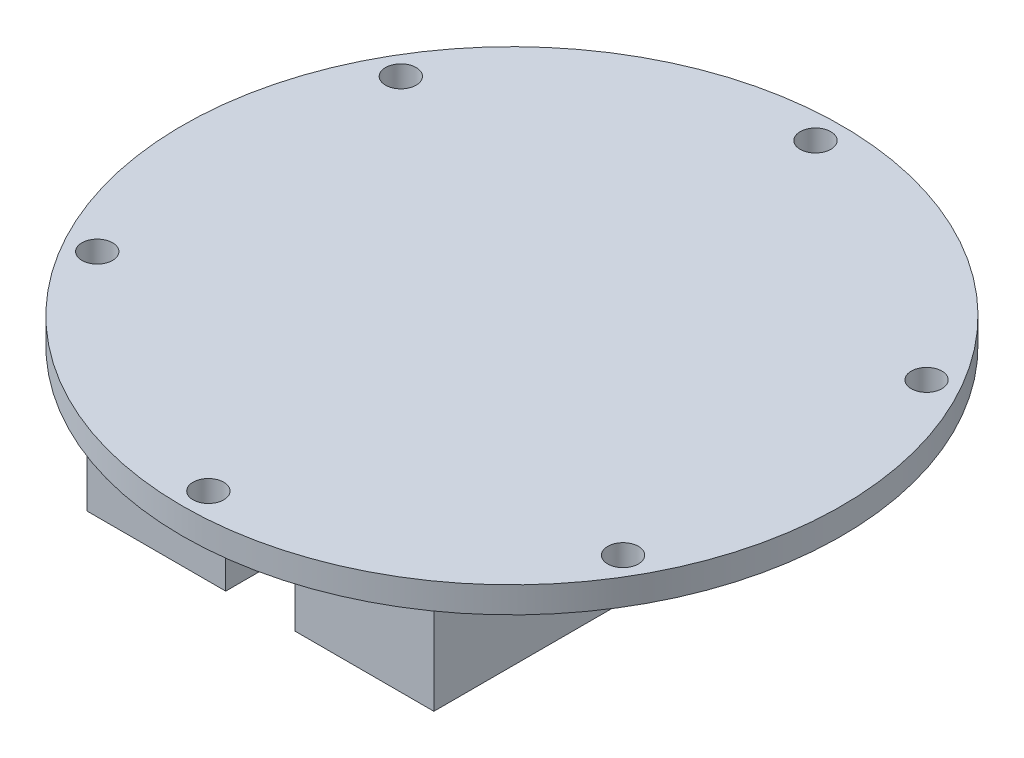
ISO-10303-21;
HEADER;
FILE_DESCRIPTION(('STEP AP214'),'2;1');
FILE_NAME('part.step','',(''),(''),'','','');
FILE_SCHEMA(('AUTOMOTIVE_DESIGN { 1 0 10303 214 1 1 1 1 }'));
ENDSEC;
DATA;
#1=APPLICATION_CONTEXT('core data for automotive mechanical design processes');
#2=APPLICATION_PROTOCOL_DEFINITION('international standard','automotive_design',2000,#1);
#3=PRODUCT_CONTEXT('',#1,'mechanical');
#4=PRODUCT('Part','Part','',(#3));
#5=PRODUCT_RELATED_PRODUCT_CATEGORY('part','',(#4));
#6=PRODUCT_DEFINITION_FORMATION('','',#4);
#7=PRODUCT_DEFINITION_CONTEXT('part definition',#1,'design');
#8=PRODUCT_DEFINITION('design','',#6,#7);
#9=PRODUCT_DEFINITION_SHAPE('','',#8);
#10=(LENGTH_UNIT() NAMED_UNIT(*) SI_UNIT(.MILLI.,.METRE.));
#11=(NAMED_UNIT(*) PLANE_ANGLE_UNIT() SI_UNIT($,.RADIAN.));
#12=(NAMED_UNIT(*) SI_UNIT($,.STERADIAN.) SOLID_ANGLE_UNIT());
#13=UNCERTAINTY_MEASURE_WITH_UNIT(LENGTH_MEASURE(1.E-05),#10,'distance_accuracy_value','');
#14=(GEOMETRIC_REPRESENTATION_CONTEXT(3) GLOBAL_UNCERTAINTY_ASSIGNED_CONTEXT((#13)) GLOBAL_UNIT_ASSIGNED_CONTEXT((#10,
#11,#12)) REPRESENTATION_CONTEXT('',''));
#15=CARTESIAN_POINT('',(0.,0.,0.));
#16=DIRECTION('',(0.,0.,1.));
#17=DIRECTION('',(1.,0.,0.));
#18=AXIS2_PLACEMENT_3D('',#15,#16,#17);
#19=CARTESIAN_POINT('',(-60.325,-157.1625,0.));
#20=DIRECTION('',(0.,-1.,0.));
#21=DIRECTION('',(0.,0.,-1.));
#22=AXIS2_PLACEMENT_3D('',#19,#20,#21);
#23=PLANE('',#22);
#24=DIRECTION('',(1.,0.,0.));
#25=VECTOR('',#24,1.);
#26=CARTESIAN_POINT('',(-31.75,-157.1625,-46.0375));
#27=LINE('',#26,#25);
#28=CARTESIAN_POINT('',(-31.75,-157.1625,-46.0375));
#29=VERTEX_POINT('',#28);
#30=CARTESIAN_POINT('',(-6.34999999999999,-157.1625,-46.0375));
#31=VERTEX_POINT('',#30);
#32=EDGE_CURVE('E141',#29,#31,#27,.T.);
#33=ORIENTED_EDGE('',*,*,#32,.F.);
#34=DIRECTION('',(0.,0.,-1.));
#35=VECTOR('',#34,1.);
#36=CARTESIAN_POINT('',(-31.75,-157.1625,46.0375));
#37=LINE('',#36,#35);
#38=CARTESIAN_POINT('',(-31.75,-157.1625,46.0375));
#39=VERTEX_POINT('',#38);
#40=EDGE_CURVE('E110',#39,#29,#37,.T.);
#41=ORIENTED_EDGE('',*,*,#40,.F.);
#42=DIRECTION('',(-1.,0.,0.));
#43=VECTOR('',#42,1.);
#44=CARTESIAN_POINT('',(-31.75,-157.1625,46.0375));
#45=LINE('',#44,#43);
#46=CARTESIAN_POINT('',(-6.35,-157.1625,46.0375));
#47=VERTEX_POINT('',#46);
#48=EDGE_CURVE('E145',#47,#39,#45,.T.);
#49=ORIENTED_EDGE('',*,*,#48,.F.);
#50=DIRECTION('',(0.,0.,1.));
#51=VECTOR('',#50,1.);
#52=CARTESIAN_POINT('',(-6.35000000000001,-157.1625,46.0375));
#53=LINE('',#52,#51);
#54=EDGE_CURVE('E143',#31,#47,#53,.T.);
#55=ORIENTED_EDGE('',*,*,#54,.F.);
#56=EDGE_LOOP('',(#33,#41,#49,#55));
#57=FACE_BOUND('',#56,.T.);
#58=CARTESIAN_POINT('',(0.,-157.1625,55.5625));
#59=DIRECTION('',(0.,-1.,0.));
#60=DIRECTION('',(0.,0.,-1.));
#61=AXIS2_PLACEMENT_3D('',#58,#59,#60);
#62=CIRCLE('',#61,2.8067);
#63=CARTESIAN_POINT('',(0.,-157.1625,52.7558));
#64=VERTEX_POINT('',#63);
#65=EDGE_CURVE('E168',#64,#64,#62,.T.);
#66=ORIENTED_EDGE('',*,*,#65,.F.);
#67=EDGE_LOOP('',(#66));
#68=FACE_BOUND('',#67,.T.);
#69=CARTESIAN_POINT('',(48.1185364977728,-157.1625,27.7812500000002));
#70=DIRECTION('',(0.,-1.,0.));
#71=DIRECTION('',(0.,0.,-1.));
#72=AXIS2_PLACEMENT_3D('',#69,#70,#71);
#73=CIRCLE('',#72,2.8067);
#74=CARTESIAN_POINT('',(48.1185364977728,-157.1625,24.9745500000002));
#75=VERTEX_POINT('',#74);
#76=EDGE_CURVE('E174',#75,#75,#73,.T.);
#77=ORIENTED_EDGE('',*,*,#76,.F.);
#78=EDGE_LOOP('',(#77));
#79=FACE_BOUND('',#78,.T.);
#80=CARTESIAN_POINT('',(48.1185364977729,-157.1625,-27.7812499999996));
#81=DIRECTION('',(0.,-1.,0.));
#82=DIRECTION('',(0.,0.,-1.));
#83=AXIS2_PLACEMENT_3D('',#80,#81,#82);
#84=CIRCLE('',#83,2.8067);
#85=CARTESIAN_POINT('',(48.1185364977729,-157.1625,-30.5879499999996));
#86=VERTEX_POINT('',#85);
#87=EDGE_CURVE('E180',#86,#86,#84,.T.);
#88=ORIENTED_EDGE('',*,*,#87,.F.);
#89=EDGE_LOOP('',(#88));
#90=FACE_BOUND('',#89,.T.);
#91=CARTESIAN_POINT('',(2.91433543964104E-13,-157.1625,-55.5624999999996));
#92=DIRECTION('',(0.,-1.,0.));
#93=DIRECTION('',(0.,0.,-1.));
#94=AXIS2_PLACEMENT_3D('',#91,#92,#93);
#95=CIRCLE('',#94,2.8067);
#96=CARTESIAN_POINT('',(2.91433543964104E-13,-157.1625,-58.3691999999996));
#97=VERTEX_POINT('',#96);
#98=EDGE_CURVE('E186',#97,#97,#95,.T.);
#99=ORIENTED_EDGE('',*,*,#98,.F.);
#100=EDGE_LOOP('',(#99));
#101=FACE_BOUND('',#100,.T.);
#102=CARTESIAN_POINT('',(-48.1185364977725,-157.1625,-27.7812499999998));
#103=DIRECTION('',(0.,-1.,0.));
#104=DIRECTION('',(0.,0.,-1.));
#105=AXIS2_PLACEMENT_3D('',#102,#103,#104);
#106=CIRCLE('',#105,2.8067);
#107=CARTESIAN_POINT('',(-48.1185364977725,-157.1625,-30.5879499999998));
#108=VERTEX_POINT('',#107);
#109=EDGE_CURVE('E192',#108,#108,#106,.T.);
#110=ORIENTED_EDGE('',*,*,#109,.F.);
#111=EDGE_LOOP('',(#110));
#112=FACE_BOUND('',#111,.T.);
#113=CARTESIAN_POINT('',(-48.1185364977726,-157.1625,27.78125));
#114=DIRECTION('',(0.,-1.,0.));
#115=DIRECTION('',(0.,0.,-1.));
#116=AXIS2_PLACEMENT_3D('',#113,#114,#115);
#117=CIRCLE('',#116,2.8067);
#118=CARTESIAN_POINT('',(-48.1185364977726,-157.1625,24.97455));
#119=VERTEX_POINT('',#118);
#120=EDGE_CURVE('E198',#119,#119,#117,.T.);
#121=ORIENTED_EDGE('',*,*,#120,.F.);
#122=EDGE_LOOP('',(#121));
#123=FACE_BOUND('',#122,.T.);
#124=CARTESIAN_POINT('',(0.,-157.1625,0.));
#125=DIRECTION('',(0.,1.,0.));
#126=DIRECTION('',(0.,0.,1.));
#127=AXIS2_PLACEMENT_3D('',#124,#125,#126);
#128=CIRCLE('',#127,60.325);
#129=CARTESIAN_POINT('',(0.,-157.1625,60.325));
#130=VERTEX_POINT('',#129);
#131=EDGE_CURVE('E11',#130,#130,#128,.T.);
#132=ORIENTED_EDGE('',*,*,#131,.F.);
#133=EDGE_LOOP('',(#132));
#134=FACE_BOUND('',#133,.T.);
#135=DIRECTION('',(0.,0.,-1.));
#136=VECTOR('',#135,1.);
#137=CARTESIAN_POINT('',(6.35000000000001,-157.1625,46.0375));
#138=LINE('',#137,#136);
#139=CARTESIAN_POINT('',(6.35000000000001,-157.1625,46.0375));
#140=VERTEX_POINT('',#139);
#141=CARTESIAN_POINT('',(6.34999999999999,-157.1625,-46.0375));
#142=VERTEX_POINT('',#141);
#143=EDGE_CURVE('E104',#140,#142,#138,.T.);
#144=ORIENTED_EDGE('',*,*,#143,.F.);
#145=DIRECTION('',(-1.,0.,0.));
#146=VECTOR('',#145,1.);
#147=CARTESIAN_POINT('',(31.75,-157.1625,46.0375));
#148=LINE('',#147,#146);
#149=CARTESIAN_POINT('',(31.75,-157.1625,46.0375));
#150=VERTEX_POINT('',#149);
#151=EDGE_CURVE('E115',#150,#140,#148,.T.);
#152=ORIENTED_EDGE('',*,*,#151,.F.);
#153=DIRECTION('',(0.,0.,1.));
#154=VECTOR('',#153,1.);
#155=CARTESIAN_POINT('',(31.75,-157.1625,46.0375));
#156=LINE('',#155,#154);
#157=CARTESIAN_POINT('',(31.75,-157.1625,-46.0375));
#158=VERTEX_POINT('',#157);
#159=EDGE_CURVE('E125',#158,#150,#156,.T.);
#160=ORIENTED_EDGE('',*,*,#159,.F.);
#161=DIRECTION('',(1.,0.,0.));
#162=VECTOR('',#161,1.);
#163=CARTESIAN_POINT('',(31.75,-157.1625,-46.0375));
#164=LINE('',#163,#162);
#165=EDGE_CURVE('E123',#142,#158,#164,.T.);
#166=ORIENTED_EDGE('',*,*,#165,.F.);
#167=EDGE_LOOP('',(#144,#152,#160,#166));
#168=FACE_BOUND('',#167,.T.);
#169=ADVANCED_FACE('F33',(#57,#68,#79,#90,#101,#112,#123,#134,#168),#23,.T.);
#170=CARTESIAN_POINT('',(-60.325,-152.4,0.));
#171=DIRECTION('',(0.,1.,0.));
#172=DIRECTION('',(0.,0.,1.));
#173=AXIS2_PLACEMENT_3D('',#170,#171,#172);
#174=PLANE('',#173);
#175=CARTESIAN_POINT('',(0.,-152.4,55.5625));
#176=DIRECTION('',(0.,-1.,0.));
#177=DIRECTION('',(0.,0.,-1.));
#178=AXIS2_PLACEMENT_3D('',#175,#176,#177);
#179=CIRCLE('',#178,2.8067);
#180=CARTESIAN_POINT('',(0.,-152.4,52.7558));
#181=VERTEX_POINT('',#180);
#182=EDGE_CURVE('E165',#181,#181,#179,.T.);
#183=ORIENTED_EDGE('',*,*,#182,.T.);
#184=EDGE_LOOP('',(#183));
#185=FACE_BOUND('',#184,.T.);
#186=CARTESIAN_POINT('',(48.1185364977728,-152.4,27.7812500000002));
#187=DIRECTION('',(0.,-1.,0.));
#188=DIRECTION('',(0.,0.,-1.));
#189=AXIS2_PLACEMENT_3D('',#186,#187,#188);
#190=CIRCLE('',#189,2.8067);
#191=CARTESIAN_POINT('',(48.1185364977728,-152.4,24.9745500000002));
#192=VERTEX_POINT('',#191);
#193=EDGE_CURVE('E171',#192,#192,#190,.T.);
#194=ORIENTED_EDGE('',*,*,#193,.T.);
#195=EDGE_LOOP('',(#194));
#196=FACE_BOUND('',#195,.T.);
#197=CARTESIAN_POINT('',(48.1185364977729,-152.4,-27.7812499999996));
#198=DIRECTION('',(0.,-1.,0.));
#199=DIRECTION('',(0.,0.,-1.));
#200=AXIS2_PLACEMENT_3D('',#197,#198,#199);
#201=CIRCLE('',#200,2.8067);
#202=CARTESIAN_POINT('',(48.1185364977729,-152.4,-30.5879499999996));
#203=VERTEX_POINT('',#202);
#204=EDGE_CURVE('E177',#203,#203,#201,.T.);
#205=ORIENTED_EDGE('',*,*,#204,.T.);
#206=EDGE_LOOP('',(#205));
#207=FACE_BOUND('',#206,.T.);
#208=CARTESIAN_POINT('',(2.91433543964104E-13,-152.4,-55.5624999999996));
#209=DIRECTION('',(0.,-1.,0.));
#210=DIRECTION('',(0.,0.,-1.));
#211=AXIS2_PLACEMENT_3D('',#208,#209,#210);
#212=CIRCLE('',#211,2.8067);
#213=CARTESIAN_POINT('',(2.91433543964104E-13,-152.4,-58.3691999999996));
#214=VERTEX_POINT('',#213);
#215=EDGE_CURVE('E183',#214,#214,#212,.T.);
#216=ORIENTED_EDGE('',*,*,#215,.T.);
#217=EDGE_LOOP('',(#216));
#218=FACE_BOUND('',#217,.T.);
#219=CARTESIAN_POINT('',(-48.1185364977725,-152.4,-27.7812499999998));
#220=DIRECTION('',(0.,-1.,0.));
#221=DIRECTION('',(0.,0.,-1.));
#222=AXIS2_PLACEMENT_3D('',#219,#220,#221);
#223=CIRCLE('',#222,2.8067);
#224=CARTESIAN_POINT('',(-48.1185364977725,-152.4,-30.5879499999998));
#225=VERTEX_POINT('',#224);
#226=EDGE_CURVE('E189',#225,#225,#223,.T.);
#227=ORIENTED_EDGE('',*,*,#226,.T.);
#228=EDGE_LOOP('',(#227));
#229=FACE_BOUND('',#228,.T.);
#230=CARTESIAN_POINT('',(0.,-152.4,0.));
#231=DIRECTION('',(0.,1.,0.));
#232=DIRECTION('',(0.,0.,1.));
#233=AXIS2_PLACEMENT_3D('',#230,#231,#232);
#234=CIRCLE('',#233,60.325);
#235=CARTESIAN_POINT('',(0.,-152.4,60.325));
#236=VERTEX_POINT('',#235);
#237=EDGE_CURVE('E41',#236,#236,#234,.T.);
#238=ORIENTED_EDGE('',*,*,#237,.T.);
#239=EDGE_LOOP('',(#238));
#240=FACE_BOUND('',#239,.T.);
#241=CARTESIAN_POINT('',(-48.1185364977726,-152.4,27.78125));
#242=DIRECTION('',(0.,-1.,0.));
#243=DIRECTION('',(0.,0.,-1.));
#244=AXIS2_PLACEMENT_3D('',#241,#242,#243);
#245=CIRCLE('',#244,2.8067);
#246=CARTESIAN_POINT('',(-48.1185364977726,-152.4,24.97455));
#247=VERTEX_POINT('',#246);
#248=EDGE_CURVE('E195',#247,#247,#245,.T.);
#249=ORIENTED_EDGE('',*,*,#248,.T.);
#250=EDGE_LOOP('',(#249));
#251=FACE_BOUND('',#250,.T.);
#252=ADVANCED_FACE('F203',(#185,#196,#207,#218,#229,#240,#251),#174,.T.);
#253=CARTESIAN_POINT('',(0.,0.,0.));
#254=DIRECTION('',(0.,1.,0.));
#255=DIRECTION('',(0.,0.,1.));
#256=AXIS2_PLACEMENT_3D('',#253,#254,#255);
#257=CYLINDRICAL_SURFACE('',#256,60.325);
#258=ORIENTED_EDGE('',*,*,#131,.T.);
#259=EDGE_LOOP('',(#258));
#260=FACE_BOUND('',#259,.T.);
#261=ORIENTED_EDGE('',*,*,#237,.F.);
#262=EDGE_LOOP('',(#261));
#263=FACE_BOUND('',#262,.T.);
#264=ADVANCED_FACE('F35',(#260,#263),#257,.T.);
#265=CARTESIAN_POINT('',(-48.1185364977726,-157.1625,27.78125));
#266=DIRECTION('',(0.,-1.,0.));
#267=DIRECTION('',(0.,0.,-1.));
#268=AXIS2_PLACEMENT_3D('',#265,#266,#267);
#269=CYLINDRICAL_SURFACE('',#268,2.8067);
#270=ORIENTED_EDGE('',*,*,#248,.F.);
#271=EDGE_LOOP('',(#270));
#272=FACE_BOUND('',#271,.T.);
#273=ORIENTED_EDGE('',*,*,#120,.T.);
#274=EDGE_LOOP('',(#273));
#275=FACE_BOUND('',#274,.T.);
#276=ADVANCED_FACE('F207',(#272,#275),#269,.F.);
#277=CARTESIAN_POINT('',(-48.1185364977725,-157.1625,-27.7812499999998));
#278=DIRECTION('',(0.,-1.,0.));
#279=DIRECTION('',(0.,0.,-1.));
#280=AXIS2_PLACEMENT_3D('',#277,#278,#279);
#281=CYLINDRICAL_SURFACE('',#280,2.8067);
#282=ORIENTED_EDGE('',*,*,#226,.F.);
#283=EDGE_LOOP('',(#282));
#284=FACE_BOUND('',#283,.T.);
#285=ORIENTED_EDGE('',*,*,#109,.T.);
#286=EDGE_LOOP('',(#285));
#287=FACE_BOUND('',#286,.T.);
#288=ADVANCED_FACE('F213',(#284,#287),#281,.F.);
#289=CARTESIAN_POINT('',(2.91433543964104E-13,-157.1625,-55.5624999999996));
#290=DIRECTION('',(0.,-1.,0.));
#291=DIRECTION('',(0.,0.,-1.));
#292=AXIS2_PLACEMENT_3D('',#289,#290,#291);
#293=CYLINDRICAL_SURFACE('',#292,2.8067);
#294=ORIENTED_EDGE('',*,*,#215,.F.);
#295=EDGE_LOOP('',(#294));
#296=FACE_BOUND('',#295,.T.);
#297=ORIENTED_EDGE('',*,*,#98,.T.);
#298=EDGE_LOOP('',(#297));
#299=FACE_BOUND('',#298,.T.);
#300=ADVANCED_FACE('F227',(#296,#299),#293,.F.);
#301=CARTESIAN_POINT('',(48.1185364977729,-157.1625,-27.7812499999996));
#302=DIRECTION('',(0.,-1.,0.));
#303=DIRECTION('',(0.,0.,-1.));
#304=AXIS2_PLACEMENT_3D('',#301,#302,#303);
#305=CYLINDRICAL_SURFACE('',#304,2.8067);
#306=ORIENTED_EDGE('',*,*,#204,.F.);
#307=EDGE_LOOP('',(#306));
#308=FACE_BOUND('',#307,.T.);
#309=ORIENTED_EDGE('',*,*,#87,.T.);
#310=EDGE_LOOP('',(#309));
#311=FACE_BOUND('',#310,.T.);
#312=ADVANCED_FACE('F231',(#308,#311),#305,.F.);
#313=CARTESIAN_POINT('',(48.1185364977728,-157.1625,27.7812500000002));
#314=DIRECTION('',(0.,-1.,0.));
#315=DIRECTION('',(0.,0.,-1.));
#316=AXIS2_PLACEMENT_3D('',#313,#314,#315);
#317=CYLINDRICAL_SURFACE('',#316,2.8067);
#318=ORIENTED_EDGE('',*,*,#193,.F.);
#319=EDGE_LOOP('',(#318));
#320=FACE_BOUND('',#319,.T.);
#321=ORIENTED_EDGE('',*,*,#76,.T.);
#322=EDGE_LOOP('',(#321));
#323=FACE_BOUND('',#322,.T.);
#324=ADVANCED_FACE('F235',(#320,#323),#317,.F.);
#325=CARTESIAN_POINT('',(0.,-157.1625,55.5625));
#326=DIRECTION('',(0.,-1.,0.));
#327=DIRECTION('',(0.,0.,-1.));
#328=AXIS2_PLACEMENT_3D('',#325,#326,#327);
#329=CYLINDRICAL_SURFACE('',#328,2.8067);
#330=ORIENTED_EDGE('',*,*,#182,.F.);
#331=EDGE_LOOP('',(#330));
#332=FACE_BOUND('',#331,.T.);
#333=ORIENTED_EDGE('',*,*,#65,.T.);
#334=EDGE_LOOP('',(#333));
#335=FACE_BOUND('',#334,.T.);
#336=ADVANCED_FACE('F239',(#332,#335),#329,.F.);
#337=CARTESIAN_POINT('',(-31.75,-176.2125,46.0375));
#338=DIRECTION('',(1.,0.,0.));
#339=DIRECTION('',(0.,0.,-1.));
#340=AXIS2_PLACEMENT_3D('',#337,#338,#339);
#341=PLANE('',#340);
#342=ORIENTED_EDGE('',*,*,#40,.T.);
#343=DIRECTION('',(0.,1.,0.));
#344=VECTOR('',#343,1.);
#345=CARTESIAN_POINT('',(-31.75,-176.2125,-46.0375));
#346=LINE('',#345,#344);
#347=CARTESIAN_POINT('',(-31.75,-176.2125,-46.0375));
#348=VERTEX_POINT('',#347);
#349=EDGE_CURVE('E163',#348,#29,#346,.T.);
#350=ORIENTED_EDGE('',*,*,#349,.F.);
#351=DIRECTION('',(0.,0.,-1.));
#352=VECTOR('',#351,1.);
#353=CARTESIAN_POINT('',(-31.75,-176.2125,46.0375));
#354=LINE('',#353,#352);
#355=CARTESIAN_POINT('',(-31.75,-176.2125,46.0375));
#356=VERTEX_POINT('',#355);
#357=EDGE_CURVE('E147',#356,#348,#354,.T.);
#358=ORIENTED_EDGE('',*,*,#357,.F.);
#359=DIRECTION('',(0.,1.,0.));
#360=VECTOR('',#359,1.);
#361=CARTESIAN_POINT('',(-31.75,-176.2125,46.0375));
#362=LINE('',#361,#360);
#363=EDGE_CURVE('E156',#356,#39,#362,.T.);
#364=ORIENTED_EDGE('',*,*,#363,.T.);
#365=EDGE_LOOP('',(#342,#350,#358,#364));
#366=FACE_BOUND('',#365,.T.);
#367=ADVANCED_FACE('F243',(#366),#341,.F.);
#368=CARTESIAN_POINT('',(-31.75,-176.2125,-46.0375));
#369=DIRECTION('',(0.,0.,1.));
#370=DIRECTION('',(1.,0.,0.));
#371=AXIS2_PLACEMENT_3D('',#368,#369,#370);
#372=PLANE('',#371);
#373=ORIENTED_EDGE('',*,*,#32,.T.);
#374=DIRECTION('',(0.,1.,0.));
#375=VECTOR('',#374,1.);
#376=CARTESIAN_POINT('',(-6.34999999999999,-176.2125,-46.0375));
#377=LINE('',#376,#375);
#378=CARTESIAN_POINT('',(-6.34999999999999,-176.2125,-46.0375));
#379=VERTEX_POINT('',#378);
#380=EDGE_CURVE('E160',#379,#31,#377,.T.);
#381=ORIENTED_EDGE('',*,*,#380,.F.);
#382=DIRECTION('',(1.,0.,0.));
#383=VECTOR('',#382,1.);
#384=CARTESIAN_POINT('',(-31.75,-176.2125,-46.0375));
#385=LINE('',#384,#383);
#386=EDGE_CURVE('E150',#348,#379,#385,.T.);
#387=ORIENTED_EDGE('',*,*,#386,.F.);
#388=ORIENTED_EDGE('',*,*,#349,.T.);
#389=EDGE_LOOP('',(#373,#381,#387,#388));
#390=FACE_BOUND('',#389,.T.);
#391=ADVANCED_FACE('F247',(#390),#372,.F.);
#392=CARTESIAN_POINT('',(-6.35000000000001,-176.2125,46.0375));
#393=DIRECTION('',(-1.,0.,0.));
#394=DIRECTION('',(0.,0.,1.));
#395=AXIS2_PLACEMENT_3D('',#392,#393,#394);
#396=PLANE('',#395);
#397=ORIENTED_EDGE('',*,*,#54,.T.);
#398=DIRECTION('',(0.,1.,0.));
#399=VECTOR('',#398,1.);
#400=CARTESIAN_POINT('',(-6.35000000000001,-176.2125,46.0375));
#401=LINE('',#400,#399);
#402=CARTESIAN_POINT('',(-6.35000000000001,-176.2125,46.0375));
#403=VERTEX_POINT('',#402);
#404=EDGE_CURVE('E56',#403,#47,#401,.T.);
#405=ORIENTED_EDGE('',*,*,#404,.F.);
#406=DIRECTION('',(0.,0.,1.));
#407=VECTOR('',#406,1.);
#408=CARTESIAN_POINT('',(-6.35000000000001,-176.2125,46.0375));
#409=LINE('',#408,#407);
#410=EDGE_CURVE('E152',#379,#403,#409,.T.);
#411=ORIENTED_EDGE('',*,*,#410,.F.);
#412=ORIENTED_EDGE('',*,*,#380,.T.);
#413=EDGE_LOOP('',(#397,#405,#411,#412));
#414=FACE_BOUND('',#413,.T.);
#415=ADVANCED_FACE('F251',(#414),#396,.F.);
#416=CARTESIAN_POINT('',(-31.75,-176.2125,46.0375));
#417=DIRECTION('',(0.,0.,-1.));
#418=DIRECTION('',(-1.,0.,0.));
#419=AXIS2_PLACEMENT_3D('',#416,#417,#418);
#420=PLANE('',#419);
#421=ORIENTED_EDGE('',*,*,#48,.T.);
#422=ORIENTED_EDGE('',*,*,#363,.F.);
#423=DIRECTION('',(-1.,0.,0.));
#424=VECTOR('',#423,1.);
#425=CARTESIAN_POINT('',(-31.75,-176.2125,46.0375));
#426=LINE('',#425,#424);
#427=EDGE_CURVE('E154',#403,#356,#426,.T.);
#428=ORIENTED_EDGE('',*,*,#427,.F.);
#429=ORIENTED_EDGE('',*,*,#404,.T.);
#430=EDGE_LOOP('',(#421,#422,#428,#429));
#431=FACE_BOUND('',#430,.T.);
#432=ADVANCED_FACE('F255',(#431),#420,.F.);
#433=CARTESIAN_POINT('',(-31.75,-176.2125,46.0375));
#434=DIRECTION('',(0.,-1.,0.));
#435=DIRECTION('',(0.,0.,-1.));
#436=AXIS2_PLACEMENT_3D('',#433,#434,#435);
#437=PLANE('',#436);
#438=ORIENTED_EDGE('',*,*,#357,.T.);
#439=ORIENTED_EDGE('',*,*,#386,.T.);
#440=ORIENTED_EDGE('',*,*,#410,.T.);
#441=ORIENTED_EDGE('',*,*,#427,.T.);
#442=EDGE_LOOP('',(#438,#439,#440,#441));
#443=FACE_BOUND('',#442,.T.);
#444=ADVANCED_FACE('F259',(#443),#437,.T.);
#445=CARTESIAN_POINT('',(31.75,-176.2125,46.0375));
#446=DIRECTION('',(0.,0.,-1.));
#447=DIRECTION('',(-1.,0.,0.));
#448=AXIS2_PLACEMENT_3D('',#445,#446,#447);
#449=PLANE('',#448);
#450=ORIENTED_EDGE('',*,*,#151,.T.);
#451=DIRECTION('',(0.,1.,0.));
#452=VECTOR('',#451,1.);
#453=CARTESIAN_POINT('',(6.35000000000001,-176.2125,46.0375));
#454=LINE('',#453,#452);
#455=CARTESIAN_POINT('',(6.35000000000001,-176.2125,46.0375));
#456=VERTEX_POINT('',#455);
#457=EDGE_CURVE('E99',#456,#140,#454,.T.);
#458=ORIENTED_EDGE('',*,*,#457,.F.);
#459=DIRECTION('',(-1.,0.,0.));
#460=VECTOR('',#459,1.);
#461=CARTESIAN_POINT('',(31.75,-176.2125,46.0375));
#462=LINE('',#461,#460);
#463=CARTESIAN_POINT('',(31.75,-176.2125,46.0375));
#464=VERTEX_POINT('',#463);
#465=EDGE_CURVE('E129',#464,#456,#462,.T.);
#466=ORIENTED_EDGE('',*,*,#465,.F.);
#467=DIRECTION('',(0.,1.,0.));
#468=VECTOR('',#467,1.);
#469=CARTESIAN_POINT('',(31.75,-176.2125,46.0375));
#470=LINE('',#469,#468);
#471=EDGE_CURVE('E118',#464,#150,#470,.T.);
#472=ORIENTED_EDGE('',*,*,#471,.T.);
#473=EDGE_LOOP('',(#450,#458,#466,#472));
#474=FACE_BOUND('',#473,.T.);
#475=ADVANCED_FACE('F116',(#474),#449,.F.);
#476=CARTESIAN_POINT('',(6.35000000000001,-176.2125,46.0375));
#477=DIRECTION('',(1.,0.,0.));
#478=DIRECTION('',(0.,0.,-1.));
#479=AXIS2_PLACEMENT_3D('',#476,#477,#478);
#480=PLANE('',#479);
#481=ORIENTED_EDGE('',*,*,#143,.T.);
#482=DIRECTION('',(0.,1.,0.));
#483=VECTOR('',#482,1.);
#484=CARTESIAN_POINT('',(6.34999999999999,-176.2125,-46.0375));
#485=LINE('',#484,#483);
#486=CARTESIAN_POINT('',(6.34999999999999,-176.2125,-46.0375));
#487=VERTEX_POINT('',#486);
#488=EDGE_CURVE('E111',#487,#142,#485,.T.);
#489=ORIENTED_EDGE('',*,*,#488,.F.);
#490=DIRECTION('',(0.,0.,-1.));
#491=VECTOR('',#490,1.);
#492=CARTESIAN_POINT('',(6.35000000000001,-176.2125,46.0375));
#493=LINE('',#492,#491);
#494=EDGE_CURVE('E106',#456,#487,#493,.T.);
#495=ORIENTED_EDGE('',*,*,#494,.F.);
#496=ORIENTED_EDGE('',*,*,#457,.T.);
#497=EDGE_LOOP('',(#481,#489,#495,#496));
#498=FACE_BOUND('',#497,.T.);
#499=ADVANCED_FACE('F101',(#498),#480,.F.);
#500=CARTESIAN_POINT('',(31.75,-176.2125,-46.0375));
#501=DIRECTION('',(0.,0.,1.));
#502=DIRECTION('',(1.,0.,0.));
#503=AXIS2_PLACEMENT_3D('',#500,#501,#502);
#504=PLANE('',#503);
#505=ORIENTED_EDGE('',*,*,#165,.T.);
#506=DIRECTION('',(0.,1.,0.));
#507=VECTOR('',#506,1.);
#508=CARTESIAN_POINT('',(31.75,-176.2125,-46.0375));
#509=LINE('',#508,#507);
#510=CARTESIAN_POINT('',(31.75,-176.2125,-46.0375));
#511=VERTEX_POINT('',#510);
#512=EDGE_CURVE('E48',#511,#158,#509,.T.);
#513=ORIENTED_EDGE('',*,*,#512,.F.);
#514=DIRECTION('',(1.,0.,0.));
#515=VECTOR('',#514,1.);
#516=CARTESIAN_POINT('',(31.75,-176.2125,-46.0375));
#517=LINE('',#516,#515);
#518=EDGE_CURVE('E132',#487,#511,#517,.T.);
#519=ORIENTED_EDGE('',*,*,#518,.F.);
#520=ORIENTED_EDGE('',*,*,#488,.T.);
#521=EDGE_LOOP('',(#505,#513,#519,#520));
#522=FACE_BOUND('',#521,.T.);
#523=ADVANCED_FACE('F267',(#522),#504,.F.);
#524=CARTESIAN_POINT('',(31.75,-176.2125,46.0375));
#525=DIRECTION('',(-1.,0.,0.));
#526=DIRECTION('',(0.,0.,1.));
#527=AXIS2_PLACEMENT_3D('',#524,#525,#526);
#528=PLANE('',#527);
#529=ORIENTED_EDGE('',*,*,#159,.T.);
#530=ORIENTED_EDGE('',*,*,#471,.F.);
#531=DIRECTION('',(0.,0.,1.));
#532=VECTOR('',#531,1.);
#533=CARTESIAN_POINT('',(31.75,-176.2125,46.0375));
#534=LINE('',#533,#532);
#535=EDGE_CURVE('E134',#511,#464,#534,.T.);
#536=ORIENTED_EDGE('',*,*,#535,.F.);
#537=ORIENTED_EDGE('',*,*,#512,.T.);
#538=EDGE_LOOP('',(#529,#530,#536,#537));
#539=FACE_BOUND('',#538,.T.);
#540=ADVANCED_FACE('F270',(#539),#528,.F.);
#541=CARTESIAN_POINT('',(31.75,-176.2125,46.0375));
#542=DIRECTION('',(0.,-1.,0.));
#543=DIRECTION('',(0.,0.,-1.));
#544=AXIS2_PLACEMENT_3D('',#541,#542,#543);
#545=PLANE('',#544);
#546=ORIENTED_EDGE('',*,*,#465,.T.);
#547=ORIENTED_EDGE('',*,*,#494,.T.);
#548=ORIENTED_EDGE('',*,*,#518,.T.);
#549=ORIENTED_EDGE('',*,*,#535,.T.);
#550=EDGE_LOOP('',(#546,#547,#548,#549));
#551=FACE_BOUND('',#550,.T.);
#552=ADVANCED_FACE('F274',(#551),#545,.T.);
#553=CLOSED_SHELL('',(#169,#252,#264,#276,#288,#300,#312,#324,#336,#367,#391,#415,#432,#444,
#475,#499,#523,#540,#552));
#554=MANIFOLD_SOLID_BREP('B2',#553);
#555=ADVANCED_BREP_SHAPE_REPRESENTATION('',(#18,#554),#14);
#556=SHAPE_DEFINITION_REPRESENTATION(#9,#555);
ENDSEC;
END-ISO-10303-21;
